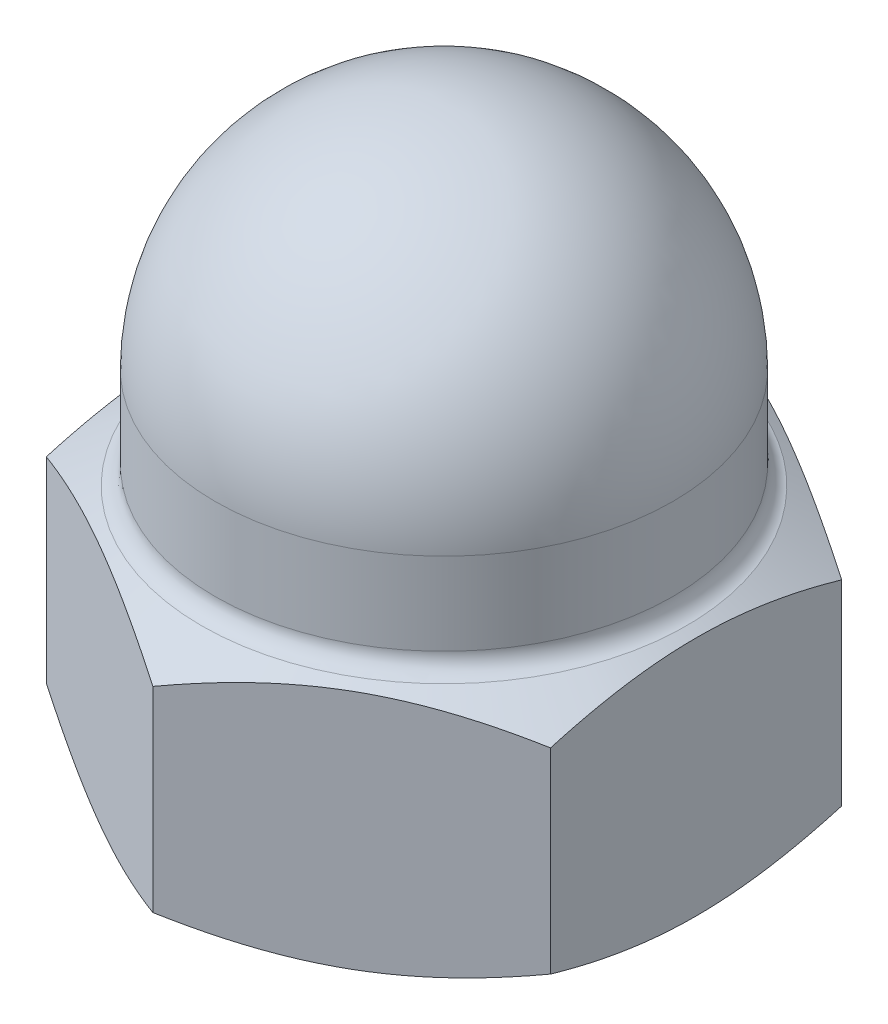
ISO-10303-21;
HEADER;
FILE_DESCRIPTION(('STEP AP214'),'2;1');
FILE_NAME('part.step','',(''),(''),'','','');
FILE_SCHEMA(('AUTOMOTIVE_DESIGN { 1 0 10303 214 1 1 1 1 }'));
ENDSEC;
DATA;
#1=APPLICATION_CONTEXT('core data for automotive mechanical design processes');
#2=APPLICATION_PROTOCOL_DEFINITION('international standard','automotive_design',2000,#1);
#3=PRODUCT_CONTEXT('',#1,'mechanical');
#4=PRODUCT('Part','Part','',(#3));
#5=PRODUCT_RELATED_PRODUCT_CATEGORY('part','',(#4));
#6=PRODUCT_DEFINITION_FORMATION('','',#4);
#7=PRODUCT_DEFINITION_CONTEXT('part definition',#1,'design');
#8=PRODUCT_DEFINITION('design','',#6,#7);
#9=PRODUCT_DEFINITION_SHAPE('','',#8);
#10=(LENGTH_UNIT() NAMED_UNIT(*) SI_UNIT(.MILLI.,.METRE.));
#11=(NAMED_UNIT(*) PLANE_ANGLE_UNIT() SI_UNIT($,.RADIAN.));
#12=(NAMED_UNIT(*) SI_UNIT($,.STERADIAN.) SOLID_ANGLE_UNIT());
#13=UNCERTAINTY_MEASURE_WITH_UNIT(LENGTH_MEASURE(1.E-05),#10,'distance_accuracy_value','');
#14=(GEOMETRIC_REPRESENTATION_CONTEXT(3) GLOBAL_UNCERTAINTY_ASSIGNED_CONTEXT((#13)) GLOBAL_UNIT_ASSIGNED_CONTEXT((#10,
#11,#12)) REPRESENTATION_CONTEXT('',''));
#15=CARTESIAN_POINT('',(0.,0.,0.));
#16=DIRECTION('',(0.,0.,1.));
#17=DIRECTION('',(1.,0.,0.));
#18=AXIS2_PLACEMENT_3D('',#15,#16,#17);
#19=CARTESIAN_POINT('',(0.,2.6,0.));
#20=DIRECTION('',(0.,-1.,0.));
#21=DIRECTION('',(-1.,0.,0.));
#22=AXIS2_PLACEMENT_3D('',#19,#20,#21);
#23=SPHERICAL_SURFACE('',#22,5.9);
#24=CARTESIAN_POINT('',(0.,2.6,0.));
#25=DIRECTION('',(0.,-1.,0.));
#26=DIRECTION('',(1.,0.,0.));
#27=AXIS2_PLACEMENT_3D('',#24,#25,#26);
#28=CIRCLE('',#27,5.9);
#29=CARTESIAN_POINT('',(5.9,2.6,0.));
#30=VERTEX_POINT('',#29);
#31=EDGE_CURVE('E198',#30,#30,#28,.T.);
#32=ORIENTED_EDGE('',*,*,#31,.F.);
#33=EDGE_LOOP('',(#32));
#34=FACE_BOUND('',#33,.T.);
#35=ADVANCED_FACE('F32',(#34),#23,.T.);
#36=CARTESIAN_POINT('',(0.,-6.5,0.));
#37=DIRECTION('',(0.,-1.,0.));
#38=DIRECTION('',(1.,0.,0.));
#39=AXIS2_PLACEMENT_3D('',#36,#37,#38);
#40=CYLINDRICAL_SURFACE('',#39,5.9);
#41=CARTESIAN_POINT('',(0.,0.476969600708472,0.));
#42=DIRECTION('',(0.,-1.,0.));
#43=DIRECTION('',(0.,0.,-1.));
#44=AXIS2_PLACEMENT_3D('',#41,#42,#43);
#45=CIRCLE('',#44,5.9);
#46=CARTESIAN_POINT('',(0.,0.476969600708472,-5.9));
#47=VERTEX_POINT('',#46);
#48=EDGE_CURVE('E11',#47,#47,#45,.F.);
#49=ORIENTED_EDGE('',*,*,#48,.T.);
#50=EDGE_LOOP('',(#49));
#51=FACE_BOUND('',#50,.T.);
#52=ORIENTED_EDGE('',*,*,#31,.T.);
#53=EDGE_LOOP('',(#52));
#54=FACE_BOUND('',#53,.T.);
#55=ADVANCED_FACE('F156',(#51,#54),#40,.T.);
#56=CARTESIAN_POINT('',(0.,-0.724894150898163,0.));
#57=DIRECTION('',(0.,-1.,0.));
#58=DIRECTION('',(0.,0.,-1.));
#59=AXIS2_PLACEMENT_3D('',#56,#57,#58);
#60=CONICAL_SURFACE('',#59,7.50555349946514,1.0471975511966);
#61=CARTESIAN_POINT('',(-6.5002,-0.724960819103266,3.75266127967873));
#62=CARTESIAN_POINT('',(-6.35732254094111,-0.677341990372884,3.83515161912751));
#63=CARTESIAN_POINT('',(-6.21391236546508,-0.631884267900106,3.91794952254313));
#64=CARTESIAN_POINT('',(-5.9259273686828,-0.545886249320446,4.08421773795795));
#65=CARTESIAN_POINT('',(-5.78135207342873,-0.505348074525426,4.16768832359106));
#66=CARTESIAN_POINT('',(-5.34531134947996,-0.39190856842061,4.41943655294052));
#67=CARTESIAN_POINT('',(-5.05212471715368,-0.327385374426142,4.5887079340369));
#68=CARTESIAN_POINT('',(-4.61337625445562,-0.251724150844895,4.84201947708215));
#69=CARTESIAN_POINT('',(-4.46912536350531,-0.230170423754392,4.92530276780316));
#70=CARTESIAN_POINT('',(-4.17997178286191,-0.194027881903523,5.09224566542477));
#71=CARTESIAN_POINT('',(-4.03506915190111,-0.179438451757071,5.17590523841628));
#72=CARTESIAN_POINT('',(-3.74501222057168,-0.157596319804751,5.34336968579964));
#73=CARTESIAN_POINT('',(-3.59985839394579,-0.150335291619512,5.427174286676));
#74=CARTESIAN_POINT('',(-3.30942466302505,-0.143297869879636,5.59485627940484));
#75=CARTESIAN_POINT('',(-3.16414476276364,-0.14352124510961,5.6787336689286));
#76=CARTESIAN_POINT('',(-2.7661240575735,-0.154421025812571,5.90853103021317));
#77=CARTESIAN_POINT('',(-2.51351353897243,-0.172719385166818,6.05437578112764));
#78=CARTESIAN_POINT('',(-2.00997032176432,-0.230743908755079,6.34509659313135));
#79=CARTESIAN_POINT('',(-1.75903939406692,-0.270489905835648,6.48997163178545));
#80=CARTESIAN_POINT('',(-1.25448277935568,-0.369843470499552,6.78127752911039));
#81=CARTESIAN_POINT('',(-1.00092075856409,-0.429871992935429,6.92767163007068));
#82=CARTESIAN_POINT('',(-0.497578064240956,-0.56611255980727,7.21827667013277));
#83=CARTESIAN_POINT('',(-0.247790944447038,-0.642292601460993,7.36249133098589));
#84=CARTESIAN_POINT('',(0.000199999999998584,-0.724960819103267,7.50566896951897));
#85=B_SPLINE_CURVE_WITH_KNOTS('',3,(#61,#62,#63,#64,#65,#66,#67,#68,#69,#70,#71,#72,#73,#74,#75,
#76,#77,#78,#79,#80,#81,#82,#83,#84),.UNSPECIFIED.,.F.,.F.,(4,2,2,2,2,2,2,2,2,2,2,4),(0.,
0.515105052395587,1.03043143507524,2.06322554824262,2.56697389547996,3.07067772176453,
3.57380860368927,4.07692394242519,4.95279354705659,5.82947446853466,6.72559912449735,
7.61996451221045),.UNSPECIFIED.);
#86=CARTESIAN_POINT('',(-6.5,-0.724894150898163,3.75277674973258));
#87=VERTEX_POINT('',#86);
#88=CARTESIAN_POINT('',(0.,-0.724894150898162,7.50555349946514));
#89=VERTEX_POINT('',#88);
#90=EDGE_CURVE('E136',#87,#89,#85,.T.);
#91=ORIENTED_EDGE('',*,*,#90,.T.);
#92=CARTESIAN_POINT('',(-0.000200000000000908,-0.724960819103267,7.50566896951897));
#93=CARTESIAN_POINT('',(0.142677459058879,-0.677341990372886,7.4231786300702));
#94=CARTESIAN_POINT('',(0.286087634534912,-0.631884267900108,7.34038072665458));
#95=CARTESIAN_POINT('',(0.574072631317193,-0.545886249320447,7.17411251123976));
#96=CARTESIAN_POINT('',(0.718647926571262,-0.505348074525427,7.09064192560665));
#97=CARTESIAN_POINT('',(1.15468865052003,-0.391908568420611,6.83889369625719));
#98=CARTESIAN_POINT('',(1.44787528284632,-0.327385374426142,6.66962231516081));
#99=CARTESIAN_POINT('',(1.88662374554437,-0.251724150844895,6.41631077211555));
#100=CARTESIAN_POINT('',(2.03087463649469,-0.230170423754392,6.33302748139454));
#101=CARTESIAN_POINT('',(2.32002821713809,-0.194027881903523,6.16608458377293));
#102=CARTESIAN_POINT('',(2.46493084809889,-0.179438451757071,6.08242501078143));
#103=CARTESIAN_POINT('',(2.75498777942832,-0.157596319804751,5.91496056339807));
#104=CARTESIAN_POINT('',(2.90014160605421,-0.150335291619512,5.8311559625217));
#105=CARTESIAN_POINT('',(3.19057533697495,-0.143297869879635,5.66347396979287));
#106=CARTESIAN_POINT('',(3.33585523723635,-0.143521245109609,5.5795965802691));
#107=CARTESIAN_POINT('',(3.73387594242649,-0.154421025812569,5.34979921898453));
#108=CARTESIAN_POINT('',(3.98648646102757,-0.172719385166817,5.20395446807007));
#109=CARTESIAN_POINT('',(4.49002967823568,-0.230743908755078,4.91323365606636));
#110=CARTESIAN_POINT('',(4.74096060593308,-0.270489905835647,4.76835861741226));
#111=CARTESIAN_POINT('',(5.24551722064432,-0.369843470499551,4.47705272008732));
#112=CARTESIAN_POINT('',(5.49907924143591,-0.429871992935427,4.33065861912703));
#113=CARTESIAN_POINT('',(6.00242193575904,-0.566112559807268,4.04005357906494));
#114=CARTESIAN_POINT('',(6.25220905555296,-0.642292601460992,3.89583891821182));
#115=CARTESIAN_POINT('',(6.5002,-0.724960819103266,3.75266127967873));
#116=B_SPLINE_CURVE_WITH_KNOTS('',3,(#92,#93,#94,#95,#96,#97,#98,#99,#100,#101,#102,#103,#104,
#105,#106,#107,#108,#109,#110,#111,#112,#113,#114,#115),.UNSPECIFIED.,.F.,.F.,(4,2,2,2,2,2,2,2,
2,2,2,4),(0.,0.515105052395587,1.03043143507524,2.06322554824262,2.56697389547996,
3.07067772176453,3.57380860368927,4.0769239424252,4.9527935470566,5.82947446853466,
6.72559912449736,7.61996451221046),.UNSPECIFIED.);
#117=CARTESIAN_POINT('',(6.5,-0.724894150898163,3.75277674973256));
#118=VERTEX_POINT('',#117);
#119=EDGE_CURVE('E167',#89,#118,#116,.T.);
#120=ORIENTED_EDGE('',*,*,#119,.T.);
#121=CARTESIAN_POINT('',(6.5,-3.24509331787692,-9.9329111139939));
#122=CARTESIAN_POINT('',(6.5,-3.10733687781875,-9.64767955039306));
#123=CARTESIAN_POINT('',(6.5,-2.97095599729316,-9.3617713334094));
#124=CARTESIAN_POINT('',(6.5,-2.70173187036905,-8.78823564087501));
#125=CARTESIAN_POINT('',(6.5,-2.56888924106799,-8.50060787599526));
#126=CARTESIAN_POINT('',(6.5,-2.30682392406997,-7.92170346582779));
#127=CARTESIAN_POINT('',(6.5,-2.17762649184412,-7.63041534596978));
#128=CARTESIAN_POINT('',(6.5,-1.92480987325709,-7.04543753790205));
#129=CARTESIAN_POINT('',(6.5,-1.80119039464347,-6.75174797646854));
#130=CARTESIAN_POINT('',(6.5,-1.55958432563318,-6.15794764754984));
#131=CARTESIAN_POINT('',(6.5,-1.44168276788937,-5.85780209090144));
#132=CARTESIAN_POINT('',(6.5,-1.21516381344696,-5.25396342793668));
#133=CARTESIAN_POINT('',(6.5,-1.10654745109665,-4.95026993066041));
#134=CARTESIAN_POINT('',(6.5,-0.901531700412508,-4.339483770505));
#135=CARTESIAN_POINT('',(6.5,-0.805106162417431,-4.03239997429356));
#136=CARTESIAN_POINT('',(6.5,-0.627617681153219,-3.41386453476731));
#137=CARTESIAN_POINT('',(6.5,-0.546549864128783,-3.10241431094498));
#138=CARTESIAN_POINT('',(6.5,-0.40371905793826,-2.47494029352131));
#139=CARTESIAN_POINT('',(6.5,-0.341962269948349,-2.1589150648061));
#140=CARTESIAN_POINT('',(6.5,-0.241944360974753,-1.52303274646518));
#141=CARTESIAN_POINT('',(6.5,-0.20368328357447,-1.20317564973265));
#142=CARTESIAN_POINT('',(6.5,-0.166366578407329,-0.722892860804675));
#143=CARTESIAN_POINT('',(6.5,-0.157270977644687,-0.563206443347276));
#144=CARTESIAN_POINT('',(6.5,-0.145844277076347,-0.243584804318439));
#145=CARTESIAN_POINT('',(6.5,-0.143513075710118,-0.0836495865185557));
#146=CARTESIAN_POINT('',(6.5,-0.14567832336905,0.236128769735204));
#147=CARTESIAN_POINT('',(6.5,-0.150172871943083,0.395971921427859));
#148=CARTESIAN_POINT('',(6.5,-0.165876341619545,0.715330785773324));
#149=CARTESIAN_POINT('',(6.5,-0.177085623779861,0.874846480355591));
#150=CARTESIAN_POINT('',(6.5,-0.21220671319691,1.26198993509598));
#151=CARTESIAN_POINT('',(6.5,-0.239512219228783,1.48931571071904));
#152=CARTESIAN_POINT('',(6.5,-0.306236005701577,1.94217299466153));
#153=CARTESIAN_POINT('',(6.5,-0.345656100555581,2.16770422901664));
#154=CARTESIAN_POINT('',(6.5,-0.48010979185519,2.84200611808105));
#155=CARTESIAN_POINT('',(6.5,-0.591246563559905,3.28760230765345));
#156=CARTESIAN_POINT('',(6.5,-0.782711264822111,3.95410051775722));
#157=CARTESIAN_POINT('',(6.5,-0.85158956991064,4.17848908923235));
#158=CARTESIAN_POINT('',(6.5,-0.996173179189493,4.62509856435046));
#159=CARTESIAN_POINT('',(6.5,-1.07187909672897,4.8473192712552));
#160=CARTESIAN_POINT('',(6.5,-1.22849877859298,5.28848357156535));
#161=CARTESIAN_POINT('',(6.5,-1.3093806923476,5.50743858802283));
#162=CARTESIAN_POINT('',(6.5,-1.47580270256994,5.94348794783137));
#163=CARTESIAN_POINT('',(6.5,-1.56134117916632,6.16058290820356));
#164=CARTESIAN_POINT('',(6.5,-1.64877146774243,6.37689512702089));
#165=B_SPLINE_CURVE_WITH_KNOTS('',3,(#121,#122,#123,#124,#125,#126,#127,#128,#129,#130,#131,
#132,#133,#134,#135,#136,#137,#138,#139,#140,#141,#142,#143,#144,#145,#146,#147,#148,#149,#150,
#151,#152,#153,#154,#155,#156,#157,#158,#159,#160,#161,#162,#163,#164),.UNSPECIFIED.,.F.,.F.,(4,
2,2,2,2,2,2,2,2,2,2,2,2,2,2,2,2,2,2,2,2,4),(0.,0.950278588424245,1.90072184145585,
2.8566391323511,3.81250628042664,4.77980343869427,5.74720821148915,6.71250133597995,
7.67748761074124,8.64278344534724,9.60808107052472,10.0877950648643,10.5675018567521,
11.0470751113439,11.5266741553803,12.2131633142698,12.8997553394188,14.2755893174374,
14.9797013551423,15.6838767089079,16.3840723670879,17.0840259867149),.UNSPECIFIED.);
#166=CARTESIAN_POINT('',(6.5,-0.724894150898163,-3.75277674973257));
#167=VERTEX_POINT('',#166);
#168=EDGE_CURVE('E233',#118,#167,#165,.F.);
#169=ORIENTED_EDGE('',*,*,#168,.T.);
#170=CARTESIAN_POINT('',(6.5002,-0.724960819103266,-3.75266127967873));
#171=CARTESIAN_POINT('',(6.35732254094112,-0.677341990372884,-3.8351516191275));
#172=CARTESIAN_POINT('',(6.21391236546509,-0.631884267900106,-3.91794952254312));
#173=CARTESIAN_POINT('',(5.92592736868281,-0.545886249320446,-4.08421773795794));
#174=CARTESIAN_POINT('',(5.78135207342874,-0.505348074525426,-4.16768832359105));
#175=CARTESIAN_POINT('',(5.34531134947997,-0.39190856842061,-4.41943655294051));
#176=CARTESIAN_POINT('',(5.05212471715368,-0.327385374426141,-4.58870793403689));
#177=CARTESIAN_POINT('',(4.61337625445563,-0.251724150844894,-4.84201947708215));
#178=CARTESIAN_POINT('',(4.46912536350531,-0.23017042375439,-4.92530276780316));
#179=CARTESIAN_POINT('',(4.17997178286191,-0.194027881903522,-5.09224566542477));
#180=CARTESIAN_POINT('',(4.03506915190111,-0.17943845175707,-5.17590523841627));
#181=CARTESIAN_POINT('',(3.74501222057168,-0.15759631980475,-5.34336968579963));
#182=CARTESIAN_POINT('',(3.59985839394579,-0.150335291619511,-5.427174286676));
#183=CARTESIAN_POINT('',(3.30942466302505,-0.143297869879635,-5.59485627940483));
#184=CARTESIAN_POINT('',(3.16414476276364,-0.143521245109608,-5.6787336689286));
#185=CARTESIAN_POINT('',(2.76612405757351,-0.154421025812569,-5.90853103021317));
#186=CARTESIAN_POINT('',(2.51351353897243,-0.172719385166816,-6.05437578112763));
#187=CARTESIAN_POINT('',(2.00997032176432,-0.230743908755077,-6.34509659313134));
#188=CARTESIAN_POINT('',(1.75903939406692,-0.270489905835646,-6.48997163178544));
#189=CARTESIAN_POINT('',(1.25448277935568,-0.36984347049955,-6.78127752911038));
#190=CARTESIAN_POINT('',(1.00092075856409,-0.429871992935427,-6.92767163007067));
#191=CARTESIAN_POINT('',(0.497578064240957,-0.566112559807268,-7.21827667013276));
#192=CARTESIAN_POINT('',(0.247790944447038,-0.642292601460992,-7.36249133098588));
#193=CARTESIAN_POINT('',(-0.000199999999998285,-0.724960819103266,-7.50566896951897));
#194=B_SPLINE_CURVE_WITH_KNOTS('',3,(#170,#171,#172,#173,#174,#175,#176,#177,#178,#179,#180,
#181,#182,#183,#184,#185,#186,#187,#188,#189,#190,#191,#192,#193),.UNSPECIFIED.,.F.,.F.,(4,2,2,
2,2,2,2,2,2,2,2,4),(0.,0.515105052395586,1.03043143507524,2.06322554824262,2.56697389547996,
3.07067772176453,3.57380860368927,4.07692394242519,4.95279354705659,5.82947446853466,
6.72559912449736,7.61996451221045),.UNSPECIFIED.);
#195=CARTESIAN_POINT('',(0.,-0.724894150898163,-7.50555349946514));
#196=VERTEX_POINT('',#195);
#197=EDGE_CURVE('E222',#167,#196,#194,.T.);
#198=ORIENTED_EDGE('',*,*,#197,.T.);
#199=CARTESIAN_POINT('',(0.000200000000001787,-0.724960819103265,-7.50566896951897));
#200=CARTESIAN_POINT('',(-0.142677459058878,-0.677341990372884,-7.4231786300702));
#201=CARTESIAN_POINT('',(-0.286087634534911,-0.631884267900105,-7.34038072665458));
#202=CARTESIAN_POINT('',(-0.574072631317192,-0.545886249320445,-7.17411251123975));
#203=CARTESIAN_POINT('',(-0.718647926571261,-0.505348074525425,-7.09064192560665));
#204=CARTESIAN_POINT('',(-1.15468865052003,-0.39190856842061,-6.83889369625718));
#205=CARTESIAN_POINT('',(-1.44787528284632,-0.32738537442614,-6.6696223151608));
#206=CARTESIAN_POINT('',(-1.88662374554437,-0.251724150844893,-6.41631077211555));
#207=CARTESIAN_POINT('',(-2.03087463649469,-0.230170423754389,-6.33302748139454));
#208=CARTESIAN_POINT('',(-2.32002821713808,-0.194027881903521,-6.16608458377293));
#209=CARTESIAN_POINT('',(-2.46493084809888,-0.179438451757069,-6.08242501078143));
#210=CARTESIAN_POINT('',(-2.75498777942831,-0.157596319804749,-5.91496056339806));
#211=CARTESIAN_POINT('',(-2.9001416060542,-0.15033529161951,-5.8311559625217));
#212=CARTESIAN_POINT('',(-3.19057533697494,-0.143297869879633,-5.66347396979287));
#213=CARTESIAN_POINT('',(-3.33585523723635,-0.143521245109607,-5.5795965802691));
#214=CARTESIAN_POINT('',(-3.73387594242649,-0.154421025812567,-5.34979921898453));
#215=CARTESIAN_POINT('',(-3.98648646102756,-0.172719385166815,-5.20395446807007));
#216=CARTESIAN_POINT('',(-4.49002967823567,-0.230743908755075,-4.91323365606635));
#217=CARTESIAN_POINT('',(-4.74096060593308,-0.270489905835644,-4.76835861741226));
#218=CARTESIAN_POINT('',(-5.24551722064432,-0.369843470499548,-4.47705272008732));
#219=CARTESIAN_POINT('',(-5.49907924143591,-0.429871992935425,-4.33065861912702));
#220=CARTESIAN_POINT('',(-6.00242193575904,-0.566112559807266,-4.04005357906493));
#221=CARTESIAN_POINT('',(-6.25220905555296,-0.64229260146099,-3.89583891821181));
#222=CARTESIAN_POINT('',(-6.5002,-0.724960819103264,-3.75266127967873));
#223=B_SPLINE_CURVE_WITH_KNOTS('',3,(#199,#200,#201,#202,#203,#204,#205,#206,#207,#208,#209,
#210,#211,#212,#213,#214,#215,#216,#217,#218,#219,#220,#221,#222),.UNSPECIFIED.,.F.,.F.,(4,2,2,
2,2,2,2,2,2,2,2,4),(0.,0.515105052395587,1.03043143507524,2.06322554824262,2.56697389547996,
3.07067772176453,3.57380860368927,4.07692394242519,4.9527935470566,5.82947446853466,
6.72559912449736,7.61996451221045),.UNSPECIFIED.);
#224=CARTESIAN_POINT('',(-6.50000000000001,-0.724894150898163,-3.75277674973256));
#225=VERTEX_POINT('',#224);
#226=EDGE_CURVE('E137',#196,#225,#223,.T.);
#227=ORIENTED_EDGE('',*,*,#226,.T.);
#228=CARTESIAN_POINT('',(-6.5,-3.24509331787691,-9.93291111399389));
#229=CARTESIAN_POINT('',(-6.5,-3.10733687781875,-9.64767955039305));
#230=CARTESIAN_POINT('',(-6.5,-2.97095599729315,-9.36177133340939));
#231=CARTESIAN_POINT('',(-6.5,-2.70173187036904,-8.78823564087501));
#232=CARTESIAN_POINT('',(-6.5,-2.56888924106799,-8.50060787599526));
#233=CARTESIAN_POINT('',(-6.5,-2.30682392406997,-7.92170346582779));
#234=CARTESIAN_POINT('',(-6.5,-2.17762649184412,-7.63041534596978));
#235=CARTESIAN_POINT('',(-6.5,-1.92480987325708,-7.04543753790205));
#236=CARTESIAN_POINT('',(-6.5,-1.80119039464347,-6.75174797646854));
#237=CARTESIAN_POINT('',(-6.5,-1.55958432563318,-6.15794764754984));
#238=CARTESIAN_POINT('',(-6.5,-1.44168276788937,-5.85780209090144));
#239=CARTESIAN_POINT('',(-6.5,-1.21516381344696,-5.25396342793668));
#240=CARTESIAN_POINT('',(-6.5,-1.10654745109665,-4.9502699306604));
#241=CARTESIAN_POINT('',(-6.5,-0.901531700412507,-4.339483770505));
#242=CARTESIAN_POINT('',(-6.5,-0.80510616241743,-4.03239997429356));
#243=CARTESIAN_POINT('',(-6.5,-0.627617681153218,-3.41386453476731));
#244=CARTESIAN_POINT('',(-6.5,-0.546549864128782,-3.10241431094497));
#245=CARTESIAN_POINT('',(-6.5,-0.403719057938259,-2.47494029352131));
#246=CARTESIAN_POINT('',(-6.5,-0.341962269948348,-2.1589150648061));
#247=CARTESIAN_POINT('',(-6.5,-0.241944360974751,-1.52303274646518));
#248=CARTESIAN_POINT('',(-6.5,-0.203683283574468,-1.20317564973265));
#249=CARTESIAN_POINT('',(-6.5,-0.166366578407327,-0.722892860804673));
#250=CARTESIAN_POINT('',(-6.5,-0.157270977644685,-0.563206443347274));
#251=CARTESIAN_POINT('',(-6.5,-0.145844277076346,-0.243584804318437));
#252=CARTESIAN_POINT('',(-6.5,-0.143513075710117,-0.0836495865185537));
#253=CARTESIAN_POINT('',(-6.5,-0.145678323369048,0.236128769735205));
#254=CARTESIAN_POINT('',(-6.5,-0.150172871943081,0.39597192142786));
#255=CARTESIAN_POINT('',(-6.5,-0.165876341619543,0.715330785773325));
#256=CARTESIAN_POINT('',(-6.5,-0.17708562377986,0.874846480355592));
#257=CARTESIAN_POINT('',(-6.5,-0.212206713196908,1.26198993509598));
#258=CARTESIAN_POINT('',(-6.5,-0.239512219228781,1.48931571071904));
#259=CARTESIAN_POINT('',(-6.5,-0.306236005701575,1.94217299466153));
#260=CARTESIAN_POINT('',(-6.5,-0.345656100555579,2.16770422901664));
#261=CARTESIAN_POINT('',(-6.5,-0.480109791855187,2.84200611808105));
#262=CARTESIAN_POINT('',(-6.5,-0.591246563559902,3.28760230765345));
#263=CARTESIAN_POINT('',(-6.5,-0.782711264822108,3.95410051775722));
#264=CARTESIAN_POINT('',(-6.5,-0.851589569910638,4.17848908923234));
#265=CARTESIAN_POINT('',(-6.5,-0.996173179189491,4.62509856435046));
#266=CARTESIAN_POINT('',(-6.5,-1.07187909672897,4.8473192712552));
#267=CARTESIAN_POINT('',(-6.5,-1.22849877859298,5.28848357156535));
#268=CARTESIAN_POINT('',(-6.5,-1.3093806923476,5.50743858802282));
#269=CARTESIAN_POINT('',(-6.5,-1.47580270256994,5.94348794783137));
#270=CARTESIAN_POINT('',(-6.5,-1.56134117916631,6.16058290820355));
#271=CARTESIAN_POINT('',(-6.5,-1.64877146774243,6.37689512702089));
#272=B_SPLINE_CURVE_WITH_KNOTS('',3,(#228,#229,#230,#231,#232,#233,#234,#235,#236,#237,#238,
#239,#240,#241,#242,#243,#244,#245,#246,#247,#248,#249,#250,#251,#252,#253,#254,#255,#256,#257,
#258,#259,#260,#261,#262,#263,#264,#265,#266,#267,#268,#269,#270,#271),.UNSPECIFIED.,.F.,.F.,(4,
2,2,2,2,2,2,2,2,2,2,2,2,2,2,2,2,2,2,2,2,4),(0.,0.950278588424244,1.90072184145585,
2.8566391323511,3.81250628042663,4.77980343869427,5.74720821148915,6.71250133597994,
7.67748761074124,8.64278344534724,9.60808107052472,10.0877950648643,10.5675018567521,
11.0470751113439,11.5266741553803,12.2131633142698,12.8997553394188,14.2755893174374,
14.9797013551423,15.6838767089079,16.3840723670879,17.0840259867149),.UNSPECIFIED.);
#273=EDGE_CURVE('E129',#225,#87,#272,.T.);
#274=ORIENTED_EDGE('',*,*,#273,.T.);
#275=EDGE_LOOP('',(#91,#120,#169,#198,#227,#274));
#276=FACE_BOUND('',#275,.T.);
#277=CARTESIAN_POINT('',(0.,0.,0.));
#278=DIRECTION('',(0.,1.,0.));
#279=DIRECTION('',(0.,0.,1.));
#280=AXIS2_PLACEMENT_3D('',#277,#278,#279);
#281=CIRCLE('',#280,6.25);
#282=CARTESIAN_POINT('',(0.,0.,6.25));
#283=VERTEX_POINT('',#282);
#284=EDGE_CURVE('E234',#283,#283,#281,.T.);
#285=ORIENTED_EDGE('',*,*,#284,.F.);
#286=EDGE_LOOP('',(#285));
#287=FACE_BOUND('',#286,.T.);
#288=ADVANCED_FACE('F123',(#276,#287),#60,.T.);
#289=CARTESIAN_POINT('',(0.,-26.3578280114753,7.50555349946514));
#290=DIRECTION('',(0.5,0.,0.866025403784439));
#291=DIRECTION('',(0.866025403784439,0.,-0.5));
#292=AXIS2_PLACEMENT_3D('',#289,#290,#291);
#293=PLANE('',#292);
#294=CARTESIAN_POINT('',(6.5002,-5.77503918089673,3.75266127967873));
#295=CARTESIAN_POINT('',(6.35732254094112,-5.82265800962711,3.8351516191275));
#296=CARTESIAN_POINT('',(6.21391236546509,-5.86811573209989,3.91794952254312));
#297=CARTESIAN_POINT('',(5.9259273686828,-5.95411375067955,4.08421773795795));
#298=CARTESIAN_POINT('',(5.78135207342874,-5.99465192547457,4.16768832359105));
#299=CARTESIAN_POINT('',(5.34531134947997,-6.10809143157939,4.41943655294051));
#300=CARTESIAN_POINT('',(5.05212471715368,-6.17261462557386,4.58870793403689));
#301=CARTESIAN_POINT('',(4.61337625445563,-6.2482758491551,4.84201947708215));
#302=CARTESIAN_POINT('',(4.46912536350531,-6.26982957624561,4.92530276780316));
#303=CARTESIAN_POINT('',(4.17997178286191,-6.30597211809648,5.09224566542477));
#304=CARTESIAN_POINT('',(4.03506915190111,-6.32056154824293,5.17590523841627));
#305=CARTESIAN_POINT('',(3.74501222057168,-6.34240368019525,5.34336968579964));
#306=CARTESIAN_POINT('',(3.59985839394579,-6.34966470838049,5.427174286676));
#307=CARTESIAN_POINT('',(3.30942466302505,-6.35670213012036,5.59485627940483));
#308=CARTESIAN_POINT('',(3.16414476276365,-6.35647875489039,5.6787336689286));
#309=CARTESIAN_POINT('',(2.76612405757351,-6.34557897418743,5.90853103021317));
#310=CARTESIAN_POINT('',(2.51351353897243,-6.32728061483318,6.05437578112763));
#311=CARTESIAN_POINT('',(2.00997032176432,-6.26925609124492,6.34509659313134));
#312=CARTESIAN_POINT('',(1.75903939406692,-6.22951009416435,6.48997163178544));
#313=CARTESIAN_POINT('',(1.25448277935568,-6.13015652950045,6.78127752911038));
#314=CARTESIAN_POINT('',(1.00092075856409,-6.07012800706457,6.92767163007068));
#315=CARTESIAN_POINT('',(0.497578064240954,-5.93388744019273,7.21827667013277));
#316=CARTESIAN_POINT('',(0.247790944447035,-5.85770739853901,7.36249133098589));
#317=CARTESIAN_POINT('',(-0.000200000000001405,-5.77503918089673,7.50566896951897));
#318=B_SPLINE_CURVE_WITH_KNOTS('',3,(#294,#295,#296,#297,#298,#299,#300,#301,#302,#303,#304,
#305,#306,#307,#308,#309,#310,#311,#312,#313,#314,#315,#316,#317),.UNSPECIFIED.,.F.,.F.,(4,2,2,
2,2,2,2,2,2,2,2,4),(0.,0.515105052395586,1.03043143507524,2.06322554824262,2.56697389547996,
3.07067772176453,3.57380860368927,4.07692394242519,4.9527935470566,5.82947446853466,
6.72559912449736,7.61996451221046),.UNSPECIFIED.);
#319=CARTESIAN_POINT('',(6.5,-5.77510584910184,3.75277674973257));
#320=VERTEX_POINT('',#319);
#321=CARTESIAN_POINT('',(0.,-5.77510584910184,7.50555349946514));
#322=VERTEX_POINT('',#321);
#323=EDGE_CURVE('E47',#320,#322,#318,.T.);
#324=ORIENTED_EDGE('',*,*,#323,.F.);
#325=DIRECTION('',(0.,1.,0.));
#326=VECTOR('',#325,1.);
#327=CARTESIAN_POINT('',(6.5,-26.3578280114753,3.75277674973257));
#328=LINE('',#327,#326);
#329=EDGE_CURVE('E204',#320,#118,#328,.T.);
#330=ORIENTED_EDGE('',*,*,#329,.T.);
#331=ORIENTED_EDGE('',*,*,#119,.F.);
#332=DIRECTION('',(0.,1.,0.));
#333=VECTOR('',#332,1.);
#334=CARTESIAN_POINT('',(0.,-26.3578280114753,7.50555349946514));
#335=LINE('',#334,#333);
#336=EDGE_CURVE('E54',#322,#89,#335,.T.);
#337=ORIENTED_EDGE('',*,*,#336,.F.);
#338=EDGE_LOOP('',(#324,#330,#331,#337));
#339=FACE_BOUND('',#338,.T.);
#340=ADVANCED_FACE('F153',(#339),#293,.T.);
#341=CARTESIAN_POINT('',(6.5,-26.3578280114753,3.75277674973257));
#342=DIRECTION('',(1.,0.,0.));
#343=DIRECTION('',(0.,0.,-1.));
#344=AXIS2_PLACEMENT_3D('',#341,#342,#343);
#345=PLANE('',#344);
#346=CARTESIAN_POINT('',(6.5,-3.25490668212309,-9.9329111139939));
#347=CARTESIAN_POINT('',(6.5,-3.39266312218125,-9.64767955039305));
#348=CARTESIAN_POINT('',(6.5,-3.52904400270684,-9.3617713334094));
#349=CARTESIAN_POINT('',(6.5,-3.79826812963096,-8.78823564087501));
#350=CARTESIAN_POINT('',(6.5,-3.93111075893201,-8.50060787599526));
#351=CARTESIAN_POINT('',(6.5,-4.19317607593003,-7.92170346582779));
#352=CARTESIAN_POINT('',(6.5,-4.32237350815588,-7.63041534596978));
#353=CARTESIAN_POINT('',(6.5,-4.57519012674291,-7.04543753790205));
#354=CARTESIAN_POINT('',(6.5,-4.69880960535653,-6.75174797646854));
#355=CARTESIAN_POINT('',(6.5,-4.94041567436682,-6.15794764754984));
#356=CARTESIAN_POINT('',(6.5,-5.05831723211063,-5.85780209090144));
#357=CARTESIAN_POINT('',(6.5,-5.28483618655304,-5.25396342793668));
#358=CARTESIAN_POINT('',(6.5,-5.39345254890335,-4.95026993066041));
#359=CARTESIAN_POINT('',(6.5,-5.59846829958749,-4.339483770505));
#360=CARTESIAN_POINT('',(6.5,-5.69489383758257,-4.03239997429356));
#361=CARTESIAN_POINT('',(6.5,-5.87238231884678,-3.41386453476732));
#362=CARTESIAN_POINT('',(6.5,-5.95345013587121,-3.10241431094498));
#363=CARTESIAN_POINT('',(6.5,-6.09628094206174,-2.47494029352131));
#364=CARTESIAN_POINT('',(6.5,-6.15803773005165,-2.1589150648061));
#365=CARTESIAN_POINT('',(6.5,-6.25805563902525,-1.52303274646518));
#366=CARTESIAN_POINT('',(6.5,-6.29631671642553,-1.20317564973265));
#367=CARTESIAN_POINT('',(6.5,-6.33363342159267,-0.722892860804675));
#368=CARTESIAN_POINT('',(6.5,-6.34272902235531,-0.563206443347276));
#369=CARTESIAN_POINT('',(6.5,-6.35415572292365,-0.243584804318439));
#370=CARTESIAN_POINT('',(6.5,-6.35648692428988,-0.083649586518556));
#371=CARTESIAN_POINT('',(6.5,-6.35432167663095,0.236128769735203));
#372=CARTESIAN_POINT('',(6.5,-6.34982712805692,0.395971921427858));
#373=CARTESIAN_POINT('',(6.5,-6.33412365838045,0.715330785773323));
#374=CARTESIAN_POINT('',(6.5,-6.32291437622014,0.87484648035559));
#375=CARTESIAN_POINT('',(6.5,-6.28779328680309,1.26198993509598));
#376=CARTESIAN_POINT('',(6.5,-6.26048778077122,1.48931571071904));
#377=CARTESIAN_POINT('',(6.5,-6.19376399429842,1.94217299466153));
#378=CARTESIAN_POINT('',(6.5,-6.15434389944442,2.16770422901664));
#379=CARTESIAN_POINT('',(6.5,-6.01989020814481,2.84200611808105));
#380=CARTESIAN_POINT('',(6.5,-5.90875343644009,3.28760230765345));
#381=CARTESIAN_POINT('',(6.5,-5.71728873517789,3.95410051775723));
#382=CARTESIAN_POINT('',(6.5,-5.64841043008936,4.17848908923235));
#383=CARTESIAN_POINT('',(6.5,-5.50382682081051,4.62509856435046));
#384=CARTESIAN_POINT('',(6.5,-5.42812090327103,4.84731927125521));
#385=CARTESIAN_POINT('',(6.5,-5.27150122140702,5.28848357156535));
#386=CARTESIAN_POINT('',(6.5,-5.19061930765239,5.50743858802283));
#387=CARTESIAN_POINT('',(6.5,-5.02419729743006,5.94348794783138));
#388=CARTESIAN_POINT('',(6.5,-4.93865882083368,6.16058290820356));
#389=CARTESIAN_POINT('',(6.5,-4.85122853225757,6.3768951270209));
#390=B_SPLINE_CURVE_WITH_KNOTS('',3,(#346,#347,#348,#349,#350,#351,#352,#353,#354,#355,#356,
#357,#358,#359,#360,#361,#362,#363,#364,#365,#366,#367,#368,#369,#370,#371,#372,#373,#374,#375,
#376,#377,#378,#379,#380,#381,#382,#383,#384,#385,#386,#387,#388,#389),.UNSPECIFIED.,.F.,.F.,(4,
2,2,2,2,2,2,2,2,2,2,2,2,2,2,2,2,2,2,2,2,4),(0.,0.950278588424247,1.90072184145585,
2.8566391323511,3.81250628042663,4.77980343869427,5.74720821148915,6.71250133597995,
7.67748761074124,8.64278344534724,9.60808107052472,10.0877950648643,10.5675018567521,
11.0470751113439,11.5266741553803,12.2131633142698,12.8997553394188,14.2755893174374,
14.9797013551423,15.6838767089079,16.3840723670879,17.0840259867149),.UNSPECIFIED.);
#391=CARTESIAN_POINT('',(6.5,-5.77510584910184,-3.75277674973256));
#392=VERTEX_POINT('',#391);
#393=EDGE_CURVE('E231',#392,#320,#390,.T.);
#394=ORIENTED_EDGE('',*,*,#393,.F.);
#395=DIRECTION('',(0.,1.,0.));
#396=VECTOR('',#395,1.);
#397=CARTESIAN_POINT('',(6.5,-26.3578280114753,-3.75277674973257));
#398=LINE('',#397,#396);
#399=EDGE_CURVE('E206',#392,#167,#398,.T.);
#400=ORIENTED_EDGE('',*,*,#399,.T.);
#401=ORIENTED_EDGE('',*,*,#168,.F.);
#402=ORIENTED_EDGE('',*,*,#329,.F.);
#403=EDGE_LOOP('',(#394,#400,#401,#402));
#404=FACE_BOUND('',#403,.T.);
#405=ADVANCED_FACE('F230',(#404),#345,.T.);
#406=CARTESIAN_POINT('',(6.5,-26.3578280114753,-3.75277674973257));
#407=DIRECTION('',(0.5,0.,-0.866025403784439));
#408=DIRECTION('',(-0.866025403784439,0.,-0.5));
#409=AXIS2_PLACEMENT_3D('',#406,#407,#408);
#410=PLANE('',#409);
#411=CARTESIAN_POINT('',(-0.000199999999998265,-5.77503918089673,-7.50566896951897));
#412=CARTESIAN_POINT('',(0.142677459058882,-5.82265800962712,-7.4231786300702));
#413=CARTESIAN_POINT('',(0.286087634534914,-5.86811573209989,-7.34038072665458));
#414=CARTESIAN_POINT('',(0.574072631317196,-5.95411375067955,-7.17411251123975));
#415=CARTESIAN_POINT('',(0.718647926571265,-5.99465192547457,-7.09064192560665));
#416=CARTESIAN_POINT('',(1.15468865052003,-6.10809143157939,-6.83889369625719));
#417=CARTESIAN_POINT('',(1.44787528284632,-6.17261462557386,-6.6696223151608));
#418=CARTESIAN_POINT('',(1.88662374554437,-6.2482758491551,-6.41631077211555));
#419=CARTESIAN_POINT('',(2.03087463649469,-6.26982957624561,-6.33302748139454));
#420=CARTESIAN_POINT('',(2.32002821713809,-6.30597211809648,-6.16608458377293));
#421=CARTESIAN_POINT('',(2.46493084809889,-6.32056154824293,-6.08242501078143));
#422=CARTESIAN_POINT('',(2.75498777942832,-6.34240368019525,-5.91496056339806));
#423=CARTESIAN_POINT('',(2.90014160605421,-6.34966470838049,-5.8311559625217));
#424=CARTESIAN_POINT('',(3.19057533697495,-6.35670213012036,-5.66347396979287));
#425=CARTESIAN_POINT('',(3.33585523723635,-6.35647875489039,-5.5795965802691));
#426=CARTESIAN_POINT('',(3.73387594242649,-6.34557897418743,-5.34979921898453));
#427=CARTESIAN_POINT('',(3.98648646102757,-6.32728061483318,-5.20395446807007));
#428=CARTESIAN_POINT('',(4.49002967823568,-6.26925609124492,-4.91323365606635));
#429=CARTESIAN_POINT('',(4.74096060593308,-6.22951009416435,-4.76835861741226));
#430=CARTESIAN_POINT('',(5.24551722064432,-6.13015652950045,-4.47705272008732));
#431=CARTESIAN_POINT('',(5.49907924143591,-6.07012800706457,-4.33065861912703));
#432=CARTESIAN_POINT('',(6.00242193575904,-5.93388744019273,-4.04005357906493));
#433=CARTESIAN_POINT('',(6.25220905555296,-5.85770739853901,-3.89583891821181));
#434=CARTESIAN_POINT('',(6.5002,-5.77503918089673,-3.75266127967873));
#435=B_SPLINE_CURVE_WITH_KNOTS('',3,(#411,#412,#413,#414,#415,#416,#417,#418,#419,#420,#421,
#422,#423,#424,#425,#426,#427,#428,#429,#430,#431,#432,#433,#434),.UNSPECIFIED.,.F.,.F.,(4,2,2,
2,2,2,2,2,2,2,2,4),(0.,0.515105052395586,1.03043143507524,2.06322554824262,2.56697389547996,
3.07067772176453,3.57380860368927,4.07692394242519,4.95279354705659,5.82947446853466,
6.72559912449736,7.61996451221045),.UNSPECIFIED.);
#436=CARTESIAN_POINT('',(0.,-5.77510584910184,-7.50555349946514));
#437=VERTEX_POINT('',#436);
#438=EDGE_CURVE('E254',#437,#392,#435,.T.);
#439=ORIENTED_EDGE('',*,*,#438,.F.);
#440=DIRECTION('',(0.,1.,0.));
#441=VECTOR('',#440,1.);
#442=CARTESIAN_POINT('',(0.,-26.3578280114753,-7.50555349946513));
#443=LINE('',#442,#441);
#444=EDGE_CURVE('E208',#437,#196,#443,.T.);
#445=ORIENTED_EDGE('',*,*,#444,.T.);
#446=ORIENTED_EDGE('',*,*,#197,.F.);
#447=ORIENTED_EDGE('',*,*,#399,.F.);
#448=EDGE_LOOP('',(#439,#445,#446,#447));
#449=FACE_BOUND('',#448,.T.);
#450=ADVANCED_FACE('F247',(#449),#410,.T.);
#451=CARTESIAN_POINT('',(0.,-26.3578280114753,-7.50555349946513));
#452=DIRECTION('',(-0.5,0.,-0.866025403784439));
#453=DIRECTION('',(-0.866025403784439,0.,0.5));
#454=AXIS2_PLACEMENT_3D('',#451,#452,#453);
#455=PLANE('',#454);
#456=CARTESIAN_POINT('',(-6.5002,-5.77503918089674,-3.75266127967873));
#457=CARTESIAN_POINT('',(-6.35732254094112,-5.82265800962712,-3.8351516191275));
#458=CARTESIAN_POINT('',(-6.21391236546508,-5.8681157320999,-3.91794952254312));
#459=CARTESIAN_POINT('',(-5.9259273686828,-5.95411375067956,-4.08421773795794));
#460=CARTESIAN_POINT('',(-5.78135207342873,-5.99465192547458,-4.16768832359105));
#461=CARTESIAN_POINT('',(-5.34531134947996,-6.10809143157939,-4.41943655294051));
#462=CARTESIAN_POINT('',(-5.05212471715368,-6.17261462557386,-4.58870793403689));
#463=CARTESIAN_POINT('',(-4.61337625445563,-6.24827584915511,-4.84201947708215));
#464=CARTESIAN_POINT('',(-4.46912536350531,-6.26982957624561,-4.92530276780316));
#465=CARTESIAN_POINT('',(-4.17997178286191,-6.30597211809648,-5.09224566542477));
#466=CARTESIAN_POINT('',(-4.03506915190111,-6.32056154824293,-5.17590523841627));
#467=CARTESIAN_POINT('',(-3.74501222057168,-6.34240368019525,-5.34336968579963));
#468=CARTESIAN_POINT('',(-3.59985839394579,-6.34966470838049,-5.42717428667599));
#469=CARTESIAN_POINT('',(-3.30942466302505,-6.35670213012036,-5.59485627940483));
#470=CARTESIAN_POINT('',(-3.16414476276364,-6.35647875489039,-5.6787336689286));
#471=CARTESIAN_POINT('',(-2.76612405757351,-6.34557897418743,-5.90853103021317));
#472=CARTESIAN_POINT('',(-2.51351353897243,-6.32728061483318,-6.05437578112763));
#473=CARTESIAN_POINT('',(-2.00997032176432,-6.26925609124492,-6.34509659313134));
#474=CARTESIAN_POINT('',(-1.75903939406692,-6.22951009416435,-6.48997163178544));
#475=CARTESIAN_POINT('',(-1.25448277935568,-6.13015652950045,-6.78127752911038));
#476=CARTESIAN_POINT('',(-1.00092075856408,-6.07012800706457,-6.92767163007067));
#477=CARTESIAN_POINT('',(-0.497578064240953,-5.93388744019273,-7.21827667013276));
#478=CARTESIAN_POINT('',(-0.247790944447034,-5.85770739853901,-7.36249133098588));
#479=CARTESIAN_POINT('',(0.000200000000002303,-5.77503918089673,-7.50566896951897));
#480=B_SPLINE_CURVE_WITH_KNOTS('',3,(#456,#457,#458,#459,#460,#461,#462,#463,#464,#465,#466,
#467,#468,#469,#470,#471,#472,#473,#474,#475,#476,#477,#478,#479),.UNSPECIFIED.,.F.,.F.,(4,2,2,
2,2,2,2,2,2,2,2,4),(0.,0.515105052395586,1.03043143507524,2.06322554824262,2.56697389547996,
3.07067772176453,3.57380860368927,4.07692394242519,4.9527935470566,5.82947446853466,
6.72559912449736,7.61996451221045),.UNSPECIFIED.);
#481=CARTESIAN_POINT('',(-6.5,-5.77510584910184,-3.75277674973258));
#482=VERTEX_POINT('',#481);
#483=EDGE_CURVE('E107',#482,#437,#480,.T.);
#484=ORIENTED_EDGE('',*,*,#483,.F.);
#485=DIRECTION('',(0.,1.,0.));
#486=VECTOR('',#485,1.);
#487=CARTESIAN_POINT('',(-6.5,-26.3578280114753,-3.75277674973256));
#488=LINE('',#487,#486);
#489=EDGE_CURVE('E201',#482,#225,#488,.T.);
#490=ORIENTED_EDGE('',*,*,#489,.T.);
#491=ORIENTED_EDGE('',*,*,#226,.F.);
#492=ORIENTED_EDGE('',*,*,#444,.F.);
#493=EDGE_LOOP('',(#484,#490,#491,#492));
#494=FACE_BOUND('',#493,.T.);
#495=ADVANCED_FACE('F121',(#494),#455,.T.);
#496=CARTESIAN_POINT('',(-6.5,-26.3578280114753,-3.75277674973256));
#497=DIRECTION('',(-1.,0.,0.));
#498=DIRECTION('',(0.,0.,1.));
#499=AXIS2_PLACEMENT_3D('',#496,#497,#498);
#500=PLANE('',#499);
#501=CARTESIAN_POINT('',(-6.5,-3.25490668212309,-9.93291111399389));
#502=CARTESIAN_POINT('',(-6.5,-3.39266312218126,-9.64767955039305));
#503=CARTESIAN_POINT('',(-6.5,-3.52904400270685,-9.36177133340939));
#504=CARTESIAN_POINT('',(-6.5,-3.79826812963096,-8.78823564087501));
#505=CARTESIAN_POINT('',(-6.5,-3.93111075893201,-8.50060787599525));
#506=CARTESIAN_POINT('',(-6.5,-4.19317607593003,-7.92170346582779));
#507=CARTESIAN_POINT('',(-6.5,-4.32237350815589,-7.63041534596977));
#508=CARTESIAN_POINT('',(-6.5,-4.57519012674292,-7.04543753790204));
#509=CARTESIAN_POINT('',(-6.5,-4.69880960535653,-6.75174797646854));
#510=CARTESIAN_POINT('',(-6.5,-4.94041567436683,-6.15794764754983));
#511=CARTESIAN_POINT('',(-6.5,-5.05831723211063,-5.85780209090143));
#512=CARTESIAN_POINT('',(-6.5,-5.28483618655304,-5.25396342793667));
#513=CARTESIAN_POINT('',(-6.5,-5.39345254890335,-4.9502699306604));
#514=CARTESIAN_POINT('',(-6.5,-5.59846829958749,-4.339483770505));
#515=CARTESIAN_POINT('',(-6.5,-5.69489383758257,-4.03239997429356));
#516=CARTESIAN_POINT('',(-6.5,-5.87238231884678,-3.41386453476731));
#517=CARTESIAN_POINT('',(-6.5,-5.95345013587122,-3.10241431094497));
#518=CARTESIAN_POINT('',(-6.5,-6.09628094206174,-2.47494029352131));
#519=CARTESIAN_POINT('',(-6.5,-6.15803773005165,-2.1589150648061));
#520=CARTESIAN_POINT('',(-6.5,-6.25805563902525,-1.52303274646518));
#521=CARTESIAN_POINT('',(-6.5,-6.29631671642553,-1.20317564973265));
#522=CARTESIAN_POINT('',(-6.5,-6.33363342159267,-0.722892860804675));
#523=CARTESIAN_POINT('',(-6.5,-6.34272902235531,-0.563206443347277));
#524=CARTESIAN_POINT('',(-6.5,-6.35415572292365,-0.243584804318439));
#525=CARTESIAN_POINT('',(-6.5,-6.35648692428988,-0.0836495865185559));
#526=CARTESIAN_POINT('',(-6.5,-6.35432167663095,0.236128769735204));
#527=CARTESIAN_POINT('',(-6.5,-6.34982712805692,0.395971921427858));
#528=CARTESIAN_POINT('',(-6.5,-6.33412365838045,0.715330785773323));
#529=CARTESIAN_POINT('',(-6.5,-6.32291437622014,0.87484648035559));
#530=CARTESIAN_POINT('',(-6.5,-6.28779328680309,1.26198993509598));
#531=CARTESIAN_POINT('',(-6.5,-6.26048778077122,1.48931571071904));
#532=CARTESIAN_POINT('',(-6.5,-6.19376399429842,1.94217299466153));
#533=CARTESIAN_POINT('',(-6.5,-6.15434389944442,2.16770422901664));
#534=CARTESIAN_POINT('',(-6.5,-6.01989020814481,2.84200611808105));
#535=CARTESIAN_POINT('',(-6.5,-5.9087534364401,3.28760230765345));
#536=CARTESIAN_POINT('',(-6.5,-5.71728873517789,3.95410051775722));
#537=CARTESIAN_POINT('',(-6.5,-5.64841043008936,4.17848908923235));
#538=CARTESIAN_POINT('',(-6.5,-5.50382682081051,4.62509856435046));
#539=CARTESIAN_POINT('',(-6.5,-5.42812090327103,4.8473192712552));
#540=CARTESIAN_POINT('',(-6.5,-5.27150122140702,5.28848357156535));
#541=CARTESIAN_POINT('',(-6.5,-5.1906193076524,5.50743858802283));
#542=CARTESIAN_POINT('',(-6.5,-5.02419729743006,5.94348794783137));
#543=CARTESIAN_POINT('',(-6.5,-4.93865882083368,6.16058290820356));
#544=CARTESIAN_POINT('',(-6.5,-4.85122853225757,6.37689512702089));
#545=B_SPLINE_CURVE_WITH_KNOTS('',3,(#501,#502,#503,#504,#505,#506,#507,#508,#509,#510,#511,
#512,#513,#514,#515,#516,#517,#518,#519,#520,#521,#522,#523,#524,#525,#526,#527,#528,#529,#530,
#531,#532,#533,#534,#535,#536,#537,#538,#539,#540,#541,#542,#543,#544),.UNSPECIFIED.,.F.,.F.,(4,
2,2,2,2,2,2,2,2,2,2,2,2,2,2,2,2,2,2,2,2,4),(0.,0.950278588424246,1.90072184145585,
2.8566391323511,3.81250628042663,4.77980343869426,5.74720821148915,6.71250133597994,
7.67748761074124,8.64278344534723,9.60808107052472,10.0877950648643,10.5675018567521,
11.0470751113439,11.5266741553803,12.2131633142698,12.8997553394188,14.2755893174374,
14.9797013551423,15.6838767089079,16.3840723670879,17.0840259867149),.UNSPECIFIED.);
#546=CARTESIAN_POINT('',(-6.5,-5.77510584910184,3.75277674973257));
#547=VERTEX_POINT('',#546);
#548=EDGE_CURVE('E98',#547,#482,#545,.F.);
#549=ORIENTED_EDGE('',*,*,#548,.F.);
#550=DIRECTION('',(0.,1.,0.));
#551=VECTOR('',#550,1.);
#552=CARTESIAN_POINT('',(-6.5,-26.3578280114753,3.75277674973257));
#553=LINE('',#552,#551);
#554=EDGE_CURVE('E147',#547,#87,#553,.T.);
#555=ORIENTED_EDGE('',*,*,#554,.T.);
#556=ORIENTED_EDGE('',*,*,#273,.F.);
#557=ORIENTED_EDGE('',*,*,#489,.F.);
#558=EDGE_LOOP('',(#549,#555,#556,#557));
#559=FACE_BOUND('',#558,.T.);
#560=ADVANCED_FACE('F117',(#559),#500,.T.);
#561=CARTESIAN_POINT('',(-6.5,-26.3578280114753,3.75277674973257));
#562=DIRECTION('',(-0.5,0.,0.866025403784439));
#563=DIRECTION('',(0.866025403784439,0.,0.5));
#564=AXIS2_PLACEMENT_3D('',#561,#562,#563);
#565=PLANE('',#564);
#566=CARTESIAN_POINT('',(0.000199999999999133,-5.77503918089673,7.50566896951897));
#567=CARTESIAN_POINT('',(-0.142677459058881,-5.82265800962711,7.4231786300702));
#568=CARTESIAN_POINT('',(-0.286087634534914,-5.86811573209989,7.34038072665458));
#569=CARTESIAN_POINT('',(-0.574072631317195,-5.95411375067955,7.17411251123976));
#570=CARTESIAN_POINT('',(-0.718647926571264,-5.99465192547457,7.09064192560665));
#571=CARTESIAN_POINT('',(-1.15468865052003,-6.10809143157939,6.83889369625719));
#572=CARTESIAN_POINT('',(-1.44787528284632,-6.17261462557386,6.66962231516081));
#573=CARTESIAN_POINT('',(-1.88662374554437,-6.2482758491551,6.41631077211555));
#574=CARTESIAN_POINT('',(-2.03087463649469,-6.26982957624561,6.33302748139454));
#575=CARTESIAN_POINT('',(-2.32002821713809,-6.30597211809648,6.16608458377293));
#576=CARTESIAN_POINT('',(-2.46493084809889,-6.32056154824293,6.08242501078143));
#577=CARTESIAN_POINT('',(-2.75498777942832,-6.34240368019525,5.91496056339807));
#578=CARTESIAN_POINT('',(-2.90014160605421,-6.34966470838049,5.83115596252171));
#579=CARTESIAN_POINT('',(-3.19057533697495,-6.35670213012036,5.66347396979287));
#580=CARTESIAN_POINT('',(-3.33585523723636,-6.35647875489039,5.5795965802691));
#581=CARTESIAN_POINT('',(-3.73387594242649,-6.34557897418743,5.34979921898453));
#582=CARTESIAN_POINT('',(-3.98648646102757,-6.32728061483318,5.20395446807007));
#583=CARTESIAN_POINT('',(-4.49002967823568,-6.26925609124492,4.91323365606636));
#584=CARTESIAN_POINT('',(-4.74096060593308,-6.22951009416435,4.76835861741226));
#585=CARTESIAN_POINT('',(-5.24551722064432,-6.13015652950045,4.47705272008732));
#586=CARTESIAN_POINT('',(-5.49907924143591,-6.07012800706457,4.33065861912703));
#587=CARTESIAN_POINT('',(-6.00242193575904,-5.93388744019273,4.04005357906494));
#588=CARTESIAN_POINT('',(-6.25220905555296,-5.85770739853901,3.89583891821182));
#589=CARTESIAN_POINT('',(-6.5002,-5.77503918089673,3.75266127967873));
#590=B_SPLINE_CURVE_WITH_KNOTS('',3,(#566,#567,#568,#569,#570,#571,#572,#573,#574,#575,#576,
#577,#578,#579,#580,#581,#582,#583,#584,#585,#586,#587,#588,#589),.UNSPECIFIED.,.F.,.F.,(4,2,2,
2,2,2,2,2,2,2,2,4),(0.,0.515105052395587,1.03043143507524,2.06322554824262,2.56697389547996,
3.07067772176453,3.57380860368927,4.07692394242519,4.95279354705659,5.82947446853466,
6.72559912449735,7.61996451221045),.UNSPECIFIED.);
#591=EDGE_CURVE('E160',#322,#547,#590,.T.);
#592=ORIENTED_EDGE('',*,*,#591,.F.);
#593=ORIENTED_EDGE('',*,*,#336,.T.);
#594=ORIENTED_EDGE('',*,*,#90,.F.);
#595=ORIENTED_EDGE('',*,*,#554,.F.);
#596=EDGE_LOOP('',(#592,#593,#594,#595));
#597=FACE_BOUND('',#596,.T.);
#598=ADVANCED_FACE('F120',(#597),#565,.T.);
#599=CARTESIAN_POINT('',(0.,-6.5,0.));
#600=DIRECTION('',(0.,1.,0.));
#601=DIRECTION('',(0.,0.,1.));
#602=AXIS2_PLACEMENT_3D('',#599,#600,#601);
#603=CONICAL_SURFACE('',#602,6.25,1.0471975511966);
#604=ORIENTED_EDGE('',*,*,#323,.T.);
#605=ORIENTED_EDGE('',*,*,#591,.T.);
#606=ORIENTED_EDGE('',*,*,#548,.T.);
#607=ORIENTED_EDGE('',*,*,#483,.T.);
#608=ORIENTED_EDGE('',*,*,#438,.T.);
#609=ORIENTED_EDGE('',*,*,#393,.T.);
#610=EDGE_LOOP('',(#604,#605,#606,#607,#608,#609));
#611=FACE_BOUND('',#610,.T.);
#612=CARTESIAN_POINT('',(0.,-6.5,0.));
#613=DIRECTION('',(0.,1.,0.));
#614=DIRECTION('',(0.,0.,1.));
#615=AXIS2_PLACEMENT_3D('',#612,#613,#614);
#616=CIRCLE('',#615,6.25);
#617=CARTESIAN_POINT('',(0.,-6.5,6.25));
#618=VERTEX_POINT('',#617);
#619=EDGE_CURVE('E95',#618,#618,#616,.T.);
#620=ORIENTED_EDGE('',*,*,#619,.T.);
#621=EDGE_LOOP('',(#620));
#622=FACE_BOUND('',#621,.T.);
#623=ADVANCED_FACE('F113',(#611,#622),#603,.T.);
#624=CARTESIAN_POINT('',(-5.9,-6.5,0.));
#625=DIRECTION('',(0.,1.,0.));
#626=DIRECTION('',(-1.,0.,0.));
#627=AXIS2_PLACEMENT_3D('',#624,#625,#626);
#628=PLANE('',#627);
#629=CARTESIAN_POINT('',(0.,-6.5,0.));
#630=DIRECTION('',(0.,1.,0.));
#631=DIRECTION('',(-1.,0.,0.));
#632=AXIS2_PLACEMENT_3D('',#629,#630,#631);
#633=CIRCLE('',#632,3.98889727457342);
#634=CARTESIAN_POINT('',(3.98889727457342,-6.5,0.));
#635=VERTEX_POINT('',#634);
#636=EDGE_CURVE('E40',#635,#635,#633,.T.);
#637=ORIENTED_EDGE('',*,*,#636,.T.);
#638=EDGE_LOOP('',(#637));
#639=FACE_BOUND('',#638,.T.);
#640=ORIENTED_EDGE('',*,*,#619,.F.);
#641=EDGE_LOOP('',(#640));
#642=FACE_BOUND('',#641,.T.);
#643=ADVANCED_FACE('F176',(#639,#642),#628,.F.);
#644=CARTESIAN_POINT('',(0.,1.5,0.));
#645=DIRECTION('',(0.,-1.,0.));
#646=DIRECTION('',(1.,0.,0.));
#647=AXIS2_PLACEMENT_3D('',#644,#645,#646);
#648=CYLINDRICAL_SURFACE('',#647,3.4);
#649=CARTESIAN_POINT('',(0.,-6.16,0.));
#650=DIRECTION('',(0.,1.,0.));
#651=DIRECTION('',(-1.,0.,0.));
#652=AXIS2_PLACEMENT_3D('',#649,#650,#651);
#653=CIRCLE('',#652,3.4);
#654=CARTESIAN_POINT('',(3.4,-6.16,0.));
#655=VERTEX_POINT('',#654);
#656=EDGE_CURVE('E166',#655,#655,#653,.F.);
#657=ORIENTED_EDGE('',*,*,#656,.T.);
#658=EDGE_LOOP('',(#657));
#659=FACE_BOUND('',#658,.T.);
#660=CARTESIAN_POINT('',(0.,6.03700908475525,0.));
#661=DIRECTION('',(0.,-1.,0.));
#662=DIRECTION('',(0.,0.,-1.));
#663=AXIS2_PLACEMENT_3D('',#660,#661,#662);
#664=CIRCLE('',#663,3.4);
#665=CARTESIAN_POINT('',(0.,6.03700908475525,-3.4));
#666=VERTEX_POINT('',#665);
#667=EDGE_CURVE('E93',#666,#666,#664,.T.);
#668=ORIENTED_EDGE('',*,*,#667,.F.);
#669=EDGE_LOOP('',(#668));
#670=FACE_BOUND('',#669,.T.);
#671=ADVANCED_FACE('F182',(#659,#670),#648,.F.);
#672=CARTESIAN_POINT('',(0.,-6.16,0.));
#673=DIRECTION('',(0.,-1.,0.));
#674=DIRECTION('',(1.,0.,0.));
#675=AXIS2_PLACEMENT_3D('',#672,#673,#674);
#676=CONICAL_SURFACE('',#675,3.4,1.0471975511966);
#677=CARTESIAN_POINT('',(3.98889727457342,-6.5,0.));
#678=CARTESIAN_POINT('',(3.98276292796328,-6.49645833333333,0.));
#679=CARTESIAN_POINT('',(3.97662858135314,-6.49291666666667,0.));
#680=CARTESIAN_POINT('',(3.96435988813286,-6.48583333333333,0.));
#681=CARTESIAN_POINT('',(3.95822554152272,-6.48229166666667,0.));
#682=CARTESIAN_POINT('',(3.94595684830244,-6.47520833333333,0.));
#683=CARTESIAN_POINT('',(3.9398225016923,-6.47166666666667,0.));
#684=CARTESIAN_POINT('',(3.92755380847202,-6.46458333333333,0.));
#685=CARTESIAN_POINT('',(3.92141946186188,-6.46104166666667,0.));
#686=CARTESIAN_POINT('',(3.9091507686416,-6.45395833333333,0.));
#687=CARTESIAN_POINT('',(3.90301642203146,-6.45041666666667,0.));
#688=CARTESIAN_POINT('',(3.89074772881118,-6.44333333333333,0.));
#689=CARTESIAN_POINT('',(3.88461338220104,-6.43979166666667,0.));
#690=CARTESIAN_POINT('',(3.87234468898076,-6.43270833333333,0.));
#691=CARTESIAN_POINT('',(3.86621034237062,-6.42916666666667,0.));
#692=CARTESIAN_POINT('',(3.85394164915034,-6.42208333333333,0.));
#693=CARTESIAN_POINT('',(3.8478073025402,-6.41854166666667,0.));
#694=CARTESIAN_POINT('',(3.83553860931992,-6.41145833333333,0.));
#695=CARTESIAN_POINT('',(3.82940426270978,-6.40791666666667,0.));
#696=CARTESIAN_POINT('',(3.8171355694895,-6.40083333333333,0.));
#697=CARTESIAN_POINT('',(3.81100122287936,-6.39729166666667,0.));
#698=CARTESIAN_POINT('',(3.79873252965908,-6.39020833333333,0.));
#699=CARTESIAN_POINT('',(3.79259818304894,-6.38666666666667,0.));
#700=CARTESIAN_POINT('',(3.78032948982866,-6.37958333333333,0.));
#701=CARTESIAN_POINT('',(3.77419514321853,-6.37604166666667,0.));
#702=CARTESIAN_POINT('',(3.76192644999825,-6.36895833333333,0.));
#703=CARTESIAN_POINT('',(3.75579210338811,-6.36541666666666,0.));
#704=CARTESIAN_POINT('',(3.74352341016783,-6.35833333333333,0.));
#705=CARTESIAN_POINT('',(3.73738906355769,-6.35479166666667,0.));
#706=CARTESIAN_POINT('',(3.72512037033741,-6.34770833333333,0.));
#707=CARTESIAN_POINT('',(3.71898602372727,-6.34416666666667,0.));
#708=CARTESIAN_POINT('',(3.70671733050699,-6.33708333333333,0.));
#709=CARTESIAN_POINT('',(3.70058298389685,-6.33354166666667,0.));
#710=CARTESIAN_POINT('',(3.68831429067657,-6.32645833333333,0.));
#711=CARTESIAN_POINT('',(3.68217994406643,-6.32291666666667,0.));
#712=CARTESIAN_POINT('',(3.66991125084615,-6.31583333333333,0.));
#713=CARTESIAN_POINT('',(3.66377690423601,-6.31229166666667,0.));
#714=CARTESIAN_POINT('',(3.65150821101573,-6.30520833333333,0.));
#715=CARTESIAN_POINT('',(3.64537386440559,-6.30166666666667,0.));
#716=CARTESIAN_POINT('',(3.63310517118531,-6.29458333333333,0.));
#717=CARTESIAN_POINT('',(3.62697082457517,-6.29104166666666,0.));
#718=CARTESIAN_POINT('',(3.61470213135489,-6.28395833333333,0.));
#719=CARTESIAN_POINT('',(3.60856778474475,-6.28041666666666,0.));
#720=CARTESIAN_POINT('',(3.59629909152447,-6.27333333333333,0.));
#721=CARTESIAN_POINT('',(3.59016474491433,-6.26979166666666,0.));
#722=CARTESIAN_POINT('',(3.57789605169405,-6.26270833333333,0.));
#723=CARTESIAN_POINT('',(3.57176170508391,-6.25916666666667,0.));
#724=CARTESIAN_POINT('',(3.55949301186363,-6.25208333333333,0.));
#725=CARTESIAN_POINT('',(3.55335866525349,-6.24854166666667,0.));
#726=CARTESIAN_POINT('',(3.54108997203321,-6.24145833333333,0.));
#727=CARTESIAN_POINT('',(3.53495562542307,-6.23791666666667,0.));
#728=CARTESIAN_POINT('',(3.52268693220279,-6.23083333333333,0.));
#729=CARTESIAN_POINT('',(3.51655258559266,-6.22729166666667,0.));
#730=CARTESIAN_POINT('',(3.50428389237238,-6.22020833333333,0.));
#731=CARTESIAN_POINT('',(3.49814954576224,-6.21666666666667,0.));
#732=CARTESIAN_POINT('',(3.48588085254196,-6.20958333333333,0.));
#733=CARTESIAN_POINT('',(3.47974650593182,-6.20604166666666,0.));
#734=CARTESIAN_POINT('',(3.46747781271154,-6.19895833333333,0.));
#735=CARTESIAN_POINT('',(3.4613434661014,-6.19541666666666,0.));
#736=CARTESIAN_POINT('',(3.44907477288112,-6.18833333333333,0.));
#737=CARTESIAN_POINT('',(3.44294042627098,-6.18479166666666,0.));
#738=CARTESIAN_POINT('',(3.4306717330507,-6.17770833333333,0.));
#739=CARTESIAN_POINT('',(3.42453738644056,-6.17416666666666,0.));
#740=CARTESIAN_POINT('',(3.41226869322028,-6.16708333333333,0.));
#741=CARTESIAN_POINT('',(3.40613434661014,-6.16354166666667,0.));
#742=CARTESIAN_POINT('',(3.4,-6.16,0.));
#743=B_SPLINE_CURVE_WITH_KNOTS('',3,(#677,#678,#679,#680,#681,#682,#683,#684,#685,#686,#687,
#688,#689,#690,#691,#692,#693,#694,#695,#696,#697,#698,#699,#700,#701,#702,#703,#704,#705,#706,
#707,#708,#709,#710,#711,#712,#713,#714,#715,#716,#717,#718,#719,#720,#721,#722,#723,#724,#725,
#726,#727,#728,#729,#730,#731,#732,#733,#734,#735,#736,#737,#738,#739,#740,#741,#742),
.UNSPECIFIED.,.F.,.F.,(4,2,2,2,2,2,2,2,2,2,2,2,2,2,2,2,2,2,2,2,2,2,2,2,2,2,2,2,2,2,2,2,4),(0.,
0.0212500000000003,0.0424999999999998,0.0637500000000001,0.0850000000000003,0.10625,0.1275,
0.14875,0.17,0.19125,0.2125,0.23375,0.255,0.27625,0.2975,0.31875,0.34,0.36125,0.3825,0.40375,
0.425,0.44625,0.4675,0.48875,0.51,0.53125,0.5525,0.57375,0.595,0.61625,0.6375,0.65875,0.68),.UNSPECIFIED.);
#744=EDGE_CURVE('BSEAM179',#635,#655,#743,.T.);
#745=ORIENTED_EDGE('',*,*,#636,.F.);
#746=ORIENTED_EDGE('',*,*,#656,.F.);
#747=ORIENTED_EDGE('',*,*,#744,.T.);
#748=ORIENTED_EDGE('',*,*,#744,.F.);
#749=EDGE_LOOP('',(#745,#747,#746,#748));
#750=FACE_BOUND('',#749,.T.);
#751=ADVANCED_FACE('F179',(#750),#676,.F.);
#752=CARTESIAN_POINT('',(0.,0.476969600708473,0.));
#753=DIRECTION('',(0.,-1.,0.));
#754=DIRECTION('',(0.,0.,-1.));
#755=AXIS2_PLACEMENT_3D('',#752,#753,#754);
#756=TOROIDAL_SURFACE('',#755,6.4,0.5);
#757=ORIENTED_EDGE('',*,*,#284,.T.);
#758=EDGE_LOOP('',(#757));
#759=FACE_BOUND('',#758,.T.);
#760=ORIENTED_EDGE('',*,*,#48,.F.);
#761=EDGE_LOOP('',(#760));
#762=FACE_BOUND('',#761,.T.);
#763=ADVANCED_FACE('F34',(#759,#762),#756,.F.);
#764=CARTESIAN_POINT('',(0.,6.03700908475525,0.));
#765=DIRECTION('',(0.,-1.,0.));
#766=DIRECTION('',(0.,0.,-1.));
#767=AXIS2_PLACEMENT_3D('',#764,#765,#766);
#768=CONICAL_SURFACE('',#767,3.4,1.04719755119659);
#769=CARTESIAN_POINT('',(0.,8.,0.));
#770=VERTEX_POINT('',#769);
#771=VERTEX_LOOP('',#770);
#772=FACE_BOUND('',#771,.T.);
#773=ORIENTED_EDGE('',*,*,#667,.T.);
#774=EDGE_LOOP('',(#773));
#775=FACE_BOUND('',#774,.T.);
#776=ADVANCED_FACE('F87',(#772,#775),#768,.F.);
#777=CLOSED_SHELL('',(#35,#55,#288,#340,#405,#450,#495,#560,#598,#623,#643,#671,#751,#763,#776));
#778=MANIFOLD_SOLID_BREP('B2',#777);
#779=ADVANCED_BREP_SHAPE_REPRESENTATION('',(#18,#778),#14);
#780=SHAPE_DEFINITION_REPRESENTATION(#9,#779);
ENDSEC;
END-ISO-10303-21;
